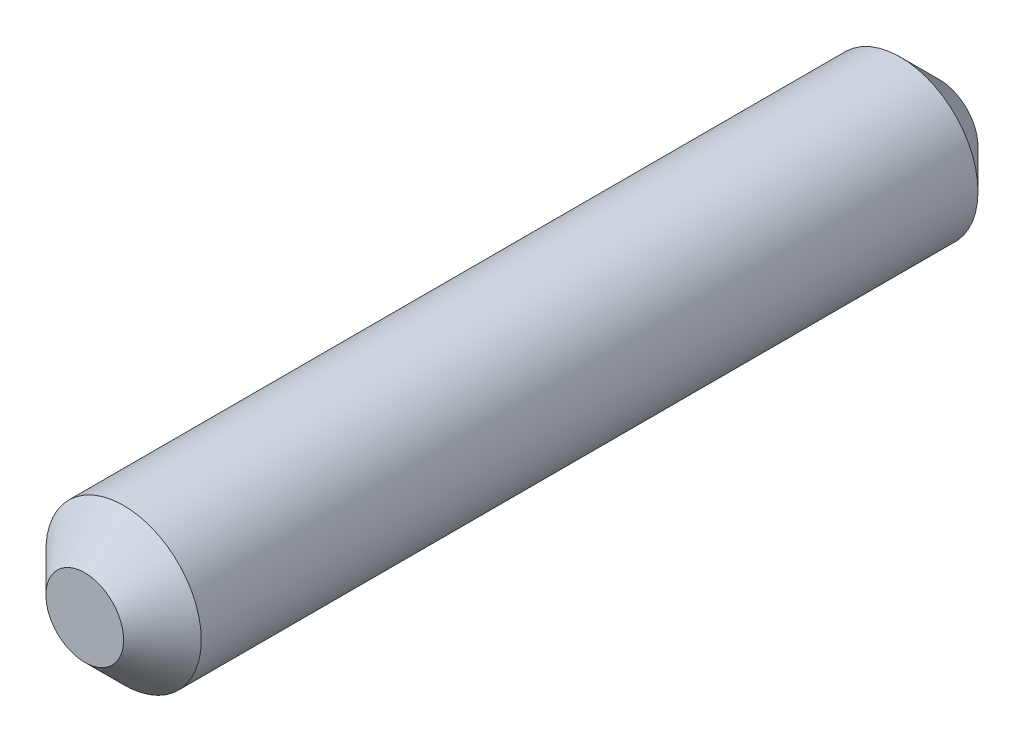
ISO-10303-21;
HEADER;
FILE_DESCRIPTION(('STEP AP214'),'2;1');
FILE_NAME('part.step','',(''),(''),'','','');
FILE_SCHEMA(('AUTOMOTIVE_DESIGN { 1 0 10303 214 1 1 1 1 }'));
ENDSEC;
DATA;
#1=APPLICATION_CONTEXT('core data for automotive mechanical design processes');
#2=APPLICATION_PROTOCOL_DEFINITION('international standard','automotive_design',2000,#1);
#3=PRODUCT_CONTEXT('',#1,'mechanical');
#4=PRODUCT('Part','Part','',(#3));
#5=PRODUCT_RELATED_PRODUCT_CATEGORY('part','',(#4));
#6=PRODUCT_DEFINITION_FORMATION('','',#4);
#7=PRODUCT_DEFINITION_CONTEXT('part definition',#1,'design');
#8=PRODUCT_DEFINITION('design','',#6,#7);
#9=PRODUCT_DEFINITION_SHAPE('','',#8);
#10=(LENGTH_UNIT() NAMED_UNIT(*) SI_UNIT(.MILLI.,.METRE.));
#11=(NAMED_UNIT(*) PLANE_ANGLE_UNIT() SI_UNIT($,.RADIAN.));
#12=(NAMED_UNIT(*) SI_UNIT($,.STERADIAN.) SOLID_ANGLE_UNIT());
#13=UNCERTAINTY_MEASURE_WITH_UNIT(LENGTH_MEASURE(1.E-05),#10,'distance_accuracy_value','');
#14=(GEOMETRIC_REPRESENTATION_CONTEXT(3) GLOBAL_UNCERTAINTY_ASSIGNED_CONTEXT((#13)) GLOBAL_UNIT_ASSIGNED_CONTEXT((#10,
#11,#12)) REPRESENTATION_CONTEXT('',''));
#15=CARTESIAN_POINT('',(0.,0.,0.));
#16=DIRECTION('',(0.,0.,1.));
#17=DIRECTION('',(1.,0.,0.));
#18=AXIS2_PLACEMENT_3D('',#15,#16,#17);
#19=CARTESIAN_POINT('',(0.,0.,11.));
#20=DIRECTION('',(0.,0.,-1.));
#21=DIRECTION('',(-1.,0.,0.));
#22=AXIS2_PLACEMENT_3D('',#19,#20,#21);
#23=CYLINDRICAL_SURFACE('',#22,1.);
#24=CARTESIAN_POINT('',(0.,0.,0.5));
#25=DIRECTION('',(0.,0.,1.));
#26=DIRECTION('',(1.,0.,0.));
#27=AXIS2_PLACEMENT_3D('',#24,#25,#26);
#28=CIRCLE('',#27,1.);
#29=CARTESIAN_POINT('',(1.,0.,0.5));
#30=VERTEX_POINT('',#29);
#31=EDGE_CURVE('E39',#30,#30,#28,.T.);
#32=ORIENTED_EDGE('',*,*,#31,.T.);
#33=EDGE_LOOP('',(#32));
#34=FACE_BOUND('',#33,.T.);
#35=CARTESIAN_POINT('',(0.,0.,10.5));
#36=DIRECTION('',(0.,0.,1.));
#37=DIRECTION('',(1.,0.,0.));
#38=AXIS2_PLACEMENT_3D('',#35,#36,#37);
#39=CIRCLE('',#38,1.);
#40=CARTESIAN_POINT('',(1.,0.,10.5));
#41=VERTEX_POINT('',#40);
#42=EDGE_CURVE('E43',#41,#41,#39,.F.);
#43=ORIENTED_EDGE('',*,*,#42,.T.);
#44=EDGE_LOOP('',(#43));
#45=FACE_BOUND('',#44,.T.);
#46=ADVANCED_FACE('F28',(#34,#45),#23,.T.);
#47=CARTESIAN_POINT('',(0.,0.,11.));
#48=DIRECTION('',(0.,0.,1.));
#49=DIRECTION('',(1.,0.,0.));
#50=AXIS2_PLACEMENT_3D('',#47,#48,#49);
#51=PLANE('',#50);
#52=CARTESIAN_POINT('',(0.,0.,11.));
#53=DIRECTION('',(0.,0.,1.));
#54=DIRECTION('',(1.,0.,0.));
#55=AXIS2_PLACEMENT_3D('',#52,#53,#54);
#56=CIRCLE('',#55,0.5);
#57=CARTESIAN_POINT('',(0.5,0.,11.));
#58=VERTEX_POINT('',#57);
#59=EDGE_CURVE('E10',#58,#58,#56,.T.);
#60=ORIENTED_EDGE('',*,*,#59,.T.);
#61=EDGE_LOOP('',(#60));
#62=FACE_BOUND('',#61,.T.);
#63=ADVANCED_FACE('F59',(#62),#51,.T.);
#64=CARTESIAN_POINT('',(0.,0.,0.));
#65=DIRECTION('',(0.,0.,1.));
#66=DIRECTION('',(1.,0.,0.));
#67=AXIS2_PLACEMENT_3D('',#64,#65,#66);
#68=PLANE('',#67);
#69=CARTESIAN_POINT('',(0.,0.,0.));
#70=DIRECTION('',(0.,0.,1.));
#71=DIRECTION('',(1.,0.,0.));
#72=AXIS2_PLACEMENT_3D('',#69,#70,#71);
#73=CIRCLE('',#72,0.499999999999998);
#74=CARTESIAN_POINT('',(0.499999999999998,0.,0.));
#75=VERTEX_POINT('',#74);
#76=EDGE_CURVE('E35',#75,#75,#73,.F.);
#77=ORIENTED_EDGE('',*,*,#76,.T.);
#78=EDGE_LOOP('',(#77));
#79=FACE_BOUND('',#78,.T.);
#80=ADVANCED_FACE('F56',(#79),#68,.F.);
#81=CARTESIAN_POINT('',(0.,0.,0.5));
#82=DIRECTION('',(0.,0.,1.));
#83=DIRECTION('',(1.,0.,0.));
#84=AXIS2_PLACEMENT_3D('',#81,#82,#83);
#85=CONICAL_SURFACE('',#84,1.,0.785398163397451);
#86=ORIENTED_EDGE('',*,*,#76,.F.);
#87=EDGE_LOOP('',(#86));
#88=FACE_BOUND('',#87,.T.);
#89=ORIENTED_EDGE('',*,*,#31,.F.);
#90=EDGE_LOOP('',(#89));
#91=FACE_BOUND('',#90,.T.);
#92=ADVANCED_FACE('F52',(#88,#91),#85,.T.);
#93=CARTESIAN_POINT('',(0.,0.,11.));
#94=DIRECTION('',(0.,0.,-1.));
#95=DIRECTION('',(-1.,0.,0.));
#96=AXIS2_PLACEMENT_3D('',#93,#94,#95);
#97=CONICAL_SURFACE('',#96,0.5,0.785398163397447);
#98=ORIENTED_EDGE('',*,*,#42,.F.);
#99=EDGE_LOOP('',(#98));
#100=FACE_BOUND('',#99,.T.);
#101=ORIENTED_EDGE('',*,*,#59,.F.);
#102=EDGE_LOOP('',(#101));
#103=FACE_BOUND('',#102,.T.);
#104=ADVANCED_FACE('F30',(#100,#103),#97,.T.);
#105=CLOSED_SHELL('',(#46,#63,#80,#92,#104));
#106=MANIFOLD_SOLID_BREP('B2',#105);
#107=ADVANCED_BREP_SHAPE_REPRESENTATION('',(#18,#106),#14);
#108=SHAPE_DEFINITION_REPRESENTATION(#9,#107);
ENDSEC;
END-ISO-10303-21;
